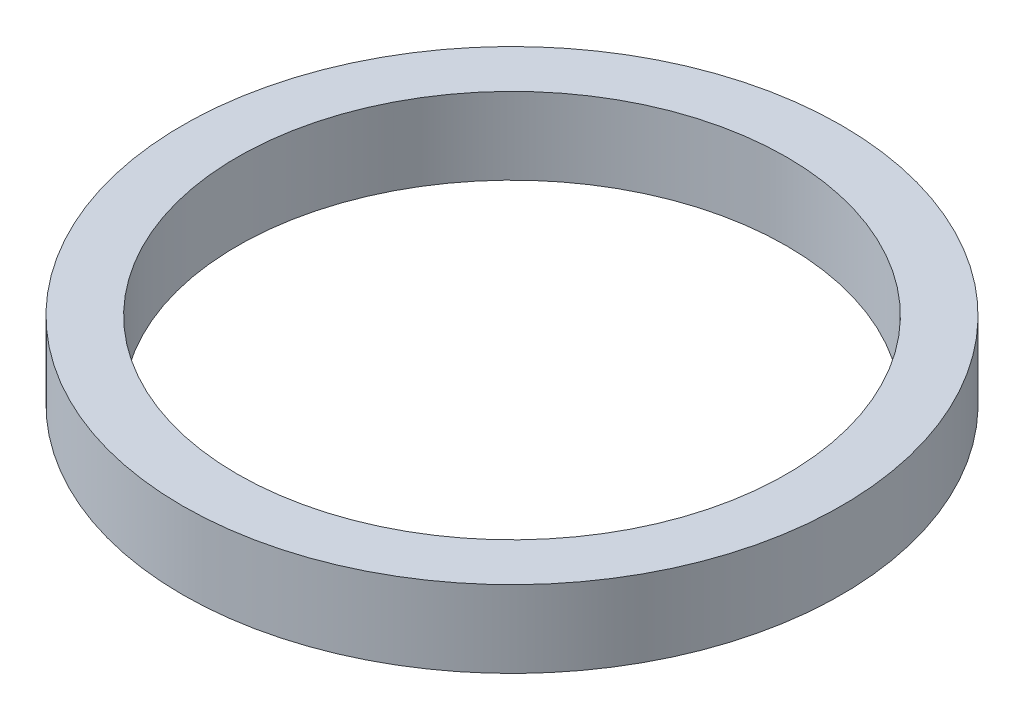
ISO-10303-21;
HEADER;
FILE_DESCRIPTION(('STEP AP214'),'2;1');
FILE_NAME('part.step','',(''),(''),'','','');
FILE_SCHEMA(('AUTOMOTIVE_DESIGN { 1 0 10303 214 1 1 1 1 }'));
ENDSEC;
DATA;
#1=APPLICATION_CONTEXT('core data for automotive mechanical design processes');
#2=APPLICATION_PROTOCOL_DEFINITION('international standard','automotive_design',2000,#1);
#3=PRODUCT_CONTEXT('',#1,'mechanical');
#4=PRODUCT('Part','Part','',(#3));
#5=PRODUCT_RELATED_PRODUCT_CATEGORY('part','',(#4));
#6=PRODUCT_DEFINITION_FORMATION('','',#4);
#7=PRODUCT_DEFINITION_CONTEXT('part definition',#1,'design');
#8=PRODUCT_DEFINITION('design','',#6,#7);
#9=PRODUCT_DEFINITION_SHAPE('','',#8);
#10=(LENGTH_UNIT() NAMED_UNIT(*) SI_UNIT(.MILLI.,.METRE.));
#11=(NAMED_UNIT(*) PLANE_ANGLE_UNIT() SI_UNIT($,.RADIAN.));
#12=(NAMED_UNIT(*) SI_UNIT($,.STERADIAN.) SOLID_ANGLE_UNIT());
#13=UNCERTAINTY_MEASURE_WITH_UNIT(LENGTH_MEASURE(1.E-05),#10,'distance_accuracy_value','');
#14=(GEOMETRIC_REPRESENTATION_CONTEXT(3) GLOBAL_UNCERTAINTY_ASSIGNED_CONTEXT((#13)) GLOBAL_UNIT_ASSIGNED_CONTEXT((#10,
#11,#12)) REPRESENTATION_CONTEXT('',''));
#15=CARTESIAN_POINT('',(0.,0.,0.));
#16=DIRECTION('',(0.,0.,1.));
#17=DIRECTION('',(1.,0.,0.));
#18=AXIS2_PLACEMENT_3D('',#15,#16,#17);
#19=CARTESIAN_POINT('',(0.,3.5,0.));
#20=DIRECTION('',(0.,-1.,0.));
#21=DIRECTION('',(0.,0.,-1.));
#22=AXIS2_PLACEMENT_3D('',#19,#20,#21);
#23=CYLINDRICAL_SURFACE('',#22,15.);
#24=CARTESIAN_POINT('',(0.,3.5,0.));
#25=DIRECTION('',(0.,1.,0.));
#26=DIRECTION('',(0.,0.,1.));
#27=AXIS2_PLACEMENT_3D('',#24,#25,#26);
#28=CIRCLE('',#27,15.);
#29=CARTESIAN_POINT('',(0.,3.5,15.));
#30=VERTEX_POINT('',#29);
#31=EDGE_CURVE('E10',#30,#30,#28,.T.);
#32=ORIENTED_EDGE('',*,*,#31,.F.);
#33=EDGE_LOOP('',(#32));
#34=FACE_BOUND('',#33,.T.);
#35=CARTESIAN_POINT('',(0.,0.,0.));
#36=DIRECTION('',(0.,1.,0.));
#37=DIRECTION('',(0.,0.,1.));
#38=AXIS2_PLACEMENT_3D('',#35,#36,#37);
#39=CIRCLE('',#38,15.);
#40=CARTESIAN_POINT('',(0.,0.,15.));
#41=VERTEX_POINT('',#40);
#42=EDGE_CURVE('E44',#41,#41,#39,.T.);
#43=ORIENTED_EDGE('',*,*,#42,.T.);
#44=EDGE_LOOP('',(#43));
#45=FACE_BOUND('',#44,.T.);
#46=ADVANCED_FACE('F41',(#34,#45),#23,.T.);
#47=CARTESIAN_POINT('',(0.,3.5,0.));
#48=DIRECTION('',(0.,1.,0.));
#49=DIRECTION('',(0.,0.,1.));
#50=AXIS2_PLACEMENT_3D('',#47,#48,#49);
#51=PLANE('',#50);
#52=CARTESIAN_POINT('',(0.,3.5,0.));
#53=DIRECTION('',(0.,1.,0.));
#54=DIRECTION('',(0.,0.,1.));
#55=AXIS2_PLACEMENT_3D('',#52,#53,#54);
#56=CIRCLE('',#55,12.5);
#57=CARTESIAN_POINT('',(0.,3.5,12.5));
#58=VERTEX_POINT('',#57);
#59=EDGE_CURVE('E55',#58,#58,#56,.T.);
#60=ORIENTED_EDGE('',*,*,#59,.F.);
#61=EDGE_LOOP('',(#60));
#62=FACE_BOUND('',#61,.T.);
#63=ORIENTED_EDGE('',*,*,#31,.T.);
#64=EDGE_LOOP('',(#63));
#65=FACE_BOUND('',#64,.T.);
#66=ADVANCED_FACE('F72',(#62,#65),#51,.T.);
#67=CARTESIAN_POINT('',(0.,0.,0.));
#68=DIRECTION('',(0.,1.,0.));
#69=DIRECTION('',(0.,0.,1.));
#70=AXIS2_PLACEMENT_3D('',#67,#68,#69);
#71=PLANE('',#70);
#72=CARTESIAN_POINT('',(0.,0.,0.));
#73=DIRECTION('',(0.,1.,0.));
#74=DIRECTION('',(0.,0.,1.));
#75=AXIS2_PLACEMENT_3D('',#72,#73,#74);
#76=CIRCLE('',#75,12.5);
#77=CARTESIAN_POINT('',(0.,0.,12.5));
#78=VERTEX_POINT('',#77);
#79=EDGE_CURVE('E53',#78,#78,#76,.T.);
#80=ORIENTED_EDGE('',*,*,#79,.T.);
#81=EDGE_LOOP('',(#80));
#82=FACE_BOUND('',#81,.T.);
#83=ORIENTED_EDGE('',*,*,#42,.F.);
#84=EDGE_LOOP('',(#83));
#85=FACE_BOUND('',#84,.T.);
#86=ADVANCED_FACE('F63',(#82,#85),#71,.F.);
#87=CARTESIAN_POINT('',(0.,0.,0.));
#88=DIRECTION('',(0.,1.,0.));
#89=DIRECTION('',(0.,0.,1.));
#90=AXIS2_PLACEMENT_3D('',#87,#88,#89);
#91=CYLINDRICAL_SURFACE('',#90,12.5);
#92=ORIENTED_EDGE('',*,*,#79,.F.);
#93=EDGE_LOOP('',(#92));
#94=FACE_BOUND('',#93,.T.);
#95=ORIENTED_EDGE('',*,*,#59,.T.);
#96=EDGE_LOOP('',(#95));
#97=FACE_BOUND('',#96,.T.);
#98=ADVANCED_FACE('F66',(#94,#97),#91,.F.);
#99=CLOSED_SHELL('',(#46,#66,#86,#98));
#100=MANIFOLD_SOLID_BREP('B2',#99);
#101=ADVANCED_BREP_SHAPE_REPRESENTATION('',(#18,#100),#14);
#102=SHAPE_DEFINITION_REPRESENTATION(#9,#101);
ENDSEC;
END-ISO-10303-21;
